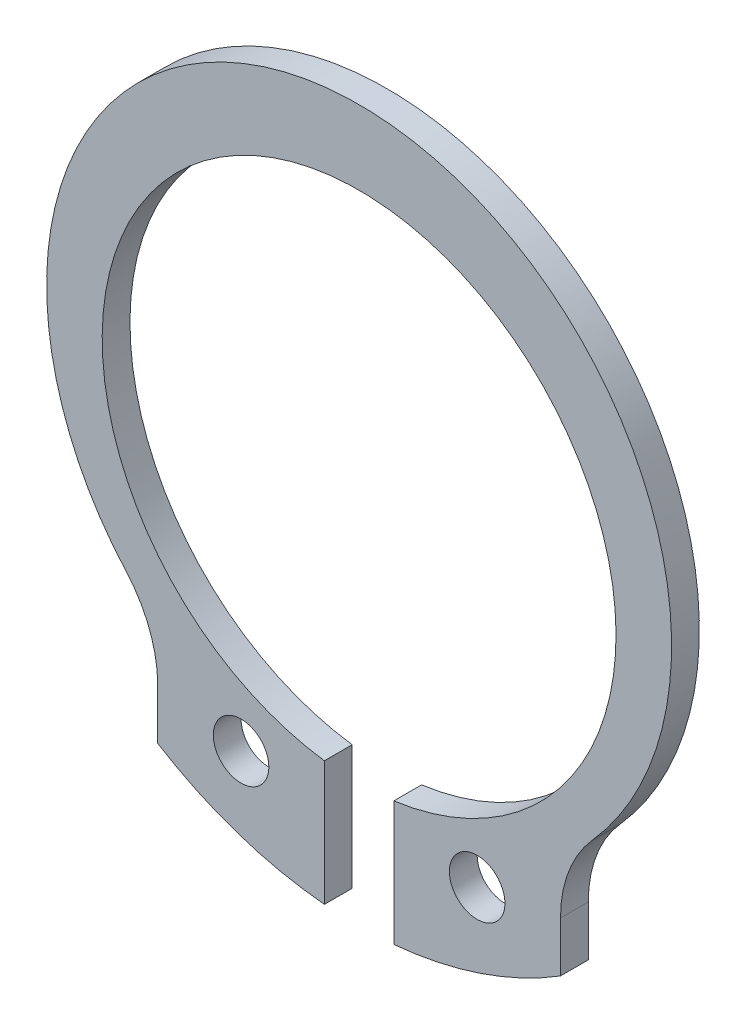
from build123d import *

# Parameters (mm, degrees)
SKETCH1_R  = 1
BODY_DEPTH = 1
FILLET1_R  = 4.5


with BuildPart() as part:
    # Sketch1 → Body (new body)
    with BuildSketch(Plane.XY):
        with BuildLine():
            Line((-1.25, -14.312855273), (-1.25, -9.83515139))
            ThreePointArc((-1.25, -9.83515139), (0, 8.58), (1.25, -9.83515139))
            Line((1.25, -9.83515139), (1.25, -14.312855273))
            ThreePointArc((1.25, -14.312855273), (4.368180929, -13.654952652), (7.25, -12.29443547))
            Line((7.25, -12.29443547), (7.25, -8.602325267))
            ThreePointArc((7.25, -8.602325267), (0, 11.25), (-7.25, -8.602325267))
            Line((-7.25, -8.602325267), (-7.25, -12.29443547))
            ThreePointArc((-7.25, -12.29443547), (-4.368180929, -13.654952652), (-1.25, -14.312855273))
        make_face()
        with Locations((-4.25, -11.032311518)):
            Circle(SKETCH1_R, mode=Mode.SUBTRACT)
        with Locations(Location((4.25, -11.032311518, 0), (0, 0, 180))):
            Circle(SKETCH1_R, mode=Mode.SUBTRACT)
    extrude(amount=-BODY_DEPTH)

    # Fillet1
    fillet1_edges = [part.edges().sort_by_distance(p)[0] for p in [
        (7.25, -8.602325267, -0.5),
        (-7.25, -8.602325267, -0.5),
    ]]
    fillet(fillet1_edges, radius=FILLET1_R)


solid = part.part
